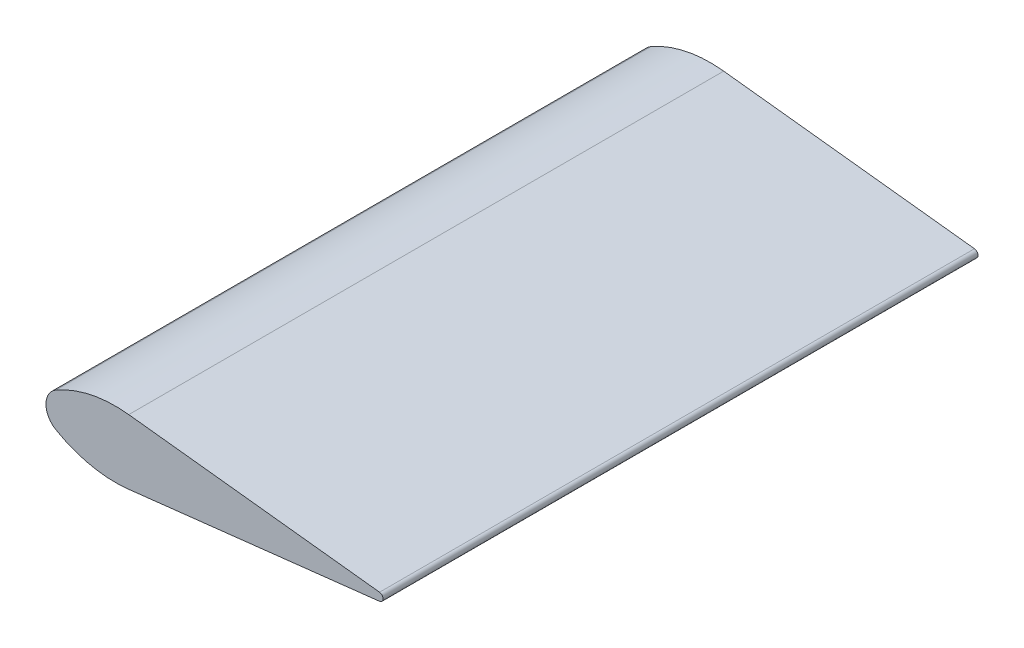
ISO-10303-21;
HEADER;
FILE_DESCRIPTION(('STEP AP214'),'2;1');
FILE_NAME('part.step','',(''),(''),'','','');
FILE_SCHEMA(('AUTOMOTIVE_DESIGN { 1 0 10303 214 1 1 1 1 }'));
ENDSEC;
DATA;
#1=APPLICATION_CONTEXT('core data for automotive mechanical design processes');
#2=APPLICATION_PROTOCOL_DEFINITION('international standard','automotive_design',2000,#1);
#3=PRODUCT_CONTEXT('',#1,'mechanical');
#4=PRODUCT('Part','Part','',(#3));
#5=PRODUCT_RELATED_PRODUCT_CATEGORY('part','',(#4));
#6=PRODUCT_DEFINITION_FORMATION('','',#4);
#7=PRODUCT_DEFINITION_CONTEXT('part definition',#1,'design');
#8=PRODUCT_DEFINITION('design','',#6,#7);
#9=PRODUCT_DEFINITION_SHAPE('','',#8);
#10=(LENGTH_UNIT() NAMED_UNIT(*) SI_UNIT(.MILLI.,.METRE.));
#11=(NAMED_UNIT(*) PLANE_ANGLE_UNIT() SI_UNIT($,.RADIAN.));
#12=(NAMED_UNIT(*) SI_UNIT($,.STERADIAN.) SOLID_ANGLE_UNIT());
#13=UNCERTAINTY_MEASURE_WITH_UNIT(LENGTH_MEASURE(1.E-05),#10,'distance_accuracy_value','');
#14=(GEOMETRIC_REPRESENTATION_CONTEXT(3) GLOBAL_UNCERTAINTY_ASSIGNED_CONTEXT((#13)) GLOBAL_UNIT_ASSIGNED_CONTEXT((#10,
#11,#12)) REPRESENTATION_CONTEXT('',''));
#15=CARTESIAN_POINT('',(0.,0.,0.));
#16=DIRECTION('',(0.,0.,1.));
#17=DIRECTION('',(1.,0.,0.));
#18=AXIS2_PLACEMENT_3D('',#15,#16,#17);
#19=CARTESIAN_POINT('',(-160.,0.,-300.));
#20=DIRECTION('',(0.,0.,1.));
#21=DIRECTION('',(-1.,0.,0.));
#22=AXIS2_PLACEMENT_3D('',#19,#20,#21);
#23=CYLINDRICAL_SURFACE('',#22,10.);
#24=CARTESIAN_POINT('',(-160.,0.,0.));
#25=DIRECTION('',(0.,0.,1.));
#26=DIRECTION('',(1.,0.,0.));
#27=AXIS2_PLACEMENT_3D('',#24,#25,#26);
#28=CIRCLE('',#27,10.);
#29=CARTESIAN_POINT('',(-165.,8.66025403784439,0.));
#30=VERTEX_POINT('',#29);
#31=CARTESIAN_POINT('',(-165.,-8.66025403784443,0.));
#32=VERTEX_POINT('',#31);
#33=EDGE_CURVE('E460',#30,#32,#28,.T.);
#34=ORIENTED_EDGE('',*,*,#33,.F.);
#35=DIRECTION('',(0.,0.,1.));
#36=VECTOR('',#35,1.);
#37=CARTESIAN_POINT('',(-165.,8.66025403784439,-300.));
#38=LINE('',#37,#36);
#39=CARTESIAN_POINT('',(-165.,8.66025403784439,-300.));
#40=VERTEX_POINT('',#39);
#41=EDGE_CURVE('E481',#40,#30,#38,.T.);
#42=ORIENTED_EDGE('',*,*,#41,.F.);
#43=CARTESIAN_POINT('',(-160.,0.,-300.));
#44=DIRECTION('',(0.,0.,1.));
#45=DIRECTION('',(1.,0.,0.));
#46=AXIS2_PLACEMENT_3D('',#43,#44,#45);
#47=CIRCLE('',#46,10.);
#48=CARTESIAN_POINT('',(-165.,-8.66025403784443,-300.));
#49=VERTEX_POINT('',#48);
#50=EDGE_CURVE('E471',#40,#49,#47,.T.);
#51=ORIENTED_EDGE('',*,*,#50,.T.);
#52=DIRECTION('',(0.,0.,1.));
#53=VECTOR('',#52,1.);
#54=CARTESIAN_POINT('',(-165.,-8.66025403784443,-300.));
#55=LINE('',#54,#53);
#56=EDGE_CURVE('E457',#49,#32,#55,.T.);
#57=ORIENTED_EDGE('',*,*,#56,.T.);
#58=EDGE_LOOP('',(#34,#42,#51,#57));
#59=FACE_BOUND('',#58,.T.);
#60=ADVANCED_FACE('F368',(#59),#23,.T.);
#61=CARTESIAN_POINT('',(-2.,0.,-300.));
#62=DIRECTION('',(0.,0.,1.));
#63=DIRECTION('',(-1.,0.,0.));
#64=AXIS2_PLACEMENT_3D('',#61,#62,#63);
#65=CYLINDRICAL_SURFACE('',#64,2.00000000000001);
#66=CARTESIAN_POINT('',(-2.,0.,0.));
#67=DIRECTION('',(0.,0.,1.));
#68=DIRECTION('',(1.,0.,0.));
#69=AXIS2_PLACEMENT_3D('',#66,#67,#68);
#70=CIRCLE('',#69,2.00000000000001);
#71=CARTESIAN_POINT('',(-1.77482640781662,-1.98728378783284,0.));
#72=VERTEX_POINT('',#71);
#73=CARTESIAN_POINT('',(-1.77482640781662,1.98728378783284,0.));
#74=VERTEX_POINT('',#73);
#75=EDGE_CURVE('E463',#72,#74,#70,.T.);
#76=ORIENTED_EDGE('',*,*,#75,.F.);
#77=DIRECTION('',(0.,0.,1.));
#78=VECTOR('',#77,1.);
#79=CARTESIAN_POINT('',(-1.77482640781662,-1.98728378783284,-300.));
#80=LINE('',#79,#78);
#81=CARTESIAN_POINT('',(-1.77482640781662,-1.98728378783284,-300.));
#82=VERTEX_POINT('',#81);
#83=EDGE_CURVE('E452',#82,#72,#80,.T.);
#84=ORIENTED_EDGE('',*,*,#83,.F.);
#85=CARTESIAN_POINT('',(-2.,0.,-300.));
#86=DIRECTION('',(0.,0.,1.));
#87=DIRECTION('',(1.,0.,0.));
#88=AXIS2_PLACEMENT_3D('',#85,#86,#87);
#89=CIRCLE('',#88,2.00000000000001);
#90=CARTESIAN_POINT('',(-1.77482640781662,1.98728378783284,-300.));
#91=VERTEX_POINT('',#90);
#92=EDGE_CURVE('E474',#82,#91,#89,.T.);
#93=ORIENTED_EDGE('',*,*,#92,.T.);
#94=DIRECTION('',(0.,0.,1.));
#95=VECTOR('',#94,1.);
#96=CARTESIAN_POINT('',(-1.77482640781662,1.98728378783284,-300.));
#97=LINE('',#96,#95);
#98=EDGE_CURVE('E11',#91,#74,#97,.T.);
#99=ORIENTED_EDGE('',*,*,#98,.T.);
#100=EDGE_LOOP('',(#76,#84,#93,#99));
#101=FACE_BOUND('',#100,.T.);
#102=ADVANCED_FACE('F492',(#101),#65,.T.);
#103=CARTESIAN_POINT('',(-128.244792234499,16.3172434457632,-300.));
#104=DIRECTION('',(-0.112586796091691,-0.993641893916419,0.));
#105=DIRECTION('',(0.993641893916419,-0.112586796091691,0.));
#106=AXIS2_PLACEMENT_3D('',#103,#104,#105);
#107=PLANE('',#106);
#108=DIRECTION('',(-0.993641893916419,0.112586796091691,0.));
#109=VECTOR('',#108,1.);
#110=CARTESIAN_POINT('',(-128.244792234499,16.3172434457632,0.));
#111=LINE('',#110,#109);
#112=CARTESIAN_POINT('',(-128.244792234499,16.3172434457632,0.));
#113=VERTEX_POINT('',#112);
#114=EDGE_CURVE('E466',#74,#113,#111,.T.);
#115=ORIENTED_EDGE('',*,*,#114,.F.);
#116=ORIENTED_EDGE('',*,*,#98,.F.);
#117=DIRECTION('',(-0.993641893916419,0.112586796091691,0.));
#118=VECTOR('',#117,1.);
#119=CARTESIAN_POINT('',(-128.244792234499,16.3172434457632,-300.));
#120=LINE('',#119,#118);
#121=CARTESIAN_POINT('',(-128.244792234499,16.3172434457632,-300.));
#122=VERTEX_POINT('',#121);
#123=EDGE_CURVE('E477',#91,#122,#120,.T.);
#124=ORIENTED_EDGE('',*,*,#123,.T.);
#125=DIRECTION('',(0.,0.,1.));
#126=VECTOR('',#125,1.);
#127=CARTESIAN_POINT('',(-128.244792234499,16.3172434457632,-300.));
#128=LINE('',#127,#126);
#129=EDGE_CURVE('E375',#122,#113,#128,.T.);
#130=ORIENTED_EDGE('',*,*,#129,.T.);
#131=EDGE_LOOP('',(#115,#116,#124,#130));
#132=FACE_BOUND('',#131,.T.);
#133=ADVANCED_FACE('F484',(#132),#107,.F.);
#134=CARTESIAN_POINT('',(-135.,-43.3012701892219,-300.));
#135=DIRECTION('',(0.,0.,1.));
#136=DIRECTION('',(-1.,0.,0.));
#137=AXIS2_PLACEMENT_3D('',#134,#135,#136);
#138=CYLINDRICAL_SURFACE('',#137,60.);
#139=CARTESIAN_POINT('',(-135.,-43.3012701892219,0.));
#140=DIRECTION('',(0.,0.,1.));
#141=DIRECTION('',(1.,0.,0.));
#142=AXIS2_PLACEMENT_3D('',#139,#140,#141);
#143=CIRCLE('',#142,60.);
#144=EDGE_CURVE('E469',#113,#30,#143,.T.);
#145=ORIENTED_EDGE('',*,*,#144,.F.);
#146=ORIENTED_EDGE('',*,*,#129,.F.);
#147=CARTESIAN_POINT('',(-135.,-43.3012701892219,-300.));
#148=DIRECTION('',(0.,0.,1.));
#149=DIRECTION('',(1.,0.,0.));
#150=AXIS2_PLACEMENT_3D('',#147,#148,#149);
#151=CIRCLE('',#150,60.);
#152=EDGE_CURVE('E382',#122,#40,#151,.T.);
#153=ORIENTED_EDGE('',*,*,#152,.T.);
#154=ORIENTED_EDGE('',*,*,#41,.T.);
#155=EDGE_LOOP('',(#145,#146,#153,#154));
#156=FACE_BOUND('',#155,.T.);
#157=ADVANCED_FACE('F504',(#156),#138,.T.);
#158=CARTESIAN_POINT('',(-160.,0.,-300.));
#159=DIRECTION('',(0.,0.,-1.));
#160=DIRECTION('',(1.,0.,0.));
#161=AXIS2_PLACEMENT_3D('',#158,#159,#160);
#162=PLANE('',#161);
#163=CARTESIAN_POINT('',(-130.,0.,-300.));
#164=DIRECTION('',(0.,0.,1.));
#165=DIRECTION('',(1.,0.,0.));
#166=AXIS2_PLACEMENT_3D('',#163,#164,#165);
#167=CIRCLE('',#166,4.24999999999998);
#168=CARTESIAN_POINT('',(-125.75,0.,-300.));
#169=VERTEX_POINT('',#168);
#170=EDGE_CURVE('E431',#169,#169,#167,.T.);
#171=ORIENTED_EDGE('',*,*,#170,.T.);
#172=EDGE_LOOP('',(#171));
#173=FACE_BOUND('',#172,.T.);
#174=CARTESIAN_POINT('',(-80.,0.,-300.));
#175=DIRECTION('',(0.,0.,1.));
#176=DIRECTION('',(1.,0.,0.));
#177=AXIS2_PLACEMENT_3D('',#174,#175,#176);
#178=CIRCLE('',#177,4.24999999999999);
#179=CARTESIAN_POINT('',(-75.75,0.,-300.));
#180=VERTEX_POINT('',#179);
#181=EDGE_CURVE('E439',#180,#180,#178,.T.);
#182=ORIENTED_EDGE('',*,*,#181,.T.);
#183=EDGE_LOOP('',(#182));
#184=FACE_BOUND('',#183,.T.);
#185=ORIENTED_EDGE('',*,*,#50,.F.);
#186=ORIENTED_EDGE('',*,*,#152,.F.);
#187=ORIENTED_EDGE('',*,*,#123,.F.);
#188=ORIENTED_EDGE('',*,*,#92,.F.);
#189=DIRECTION('',(-0.993641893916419,-0.112586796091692,0.));
#190=VECTOR('',#189,1.);
#191=CARTESIAN_POINT('',(-128.244792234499,-16.3172434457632,-300.));
#192=LINE('',#191,#190);
#193=CARTESIAN_POINT('',(-128.244792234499,-16.3172434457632,-300.));
#194=VERTEX_POINT('',#193);
#195=EDGE_CURVE('E449',#82,#194,#192,.T.);
#196=ORIENTED_EDGE('',*,*,#195,.T.);
#197=CARTESIAN_POINT('',(-135.,43.3012701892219,-300.));
#198=DIRECTION('',(0.,0.,-1.));
#199=DIRECTION('',(1.,0.,0.));
#200=AXIS2_PLACEMENT_3D('',#197,#198,#199);
#201=CIRCLE('',#200,60.);
#202=EDGE_CURVE('E447',#194,#49,#201,.T.);
#203=ORIENTED_EDGE('',*,*,#202,.T.);
#204=EDGE_LOOP('',(#185,#186,#187,#188,#196,#203));
#205=FACE_BOUND('',#204,.T.);
#206=ADVANCED_FACE('F494',(#173,#184,#205),#162,.T.);
#207=CARTESIAN_POINT('',(-160.,0.,0.));
#208=DIRECTION('',(0.,0.,-1.));
#209=DIRECTION('',(1.,0.,0.));
#210=AXIS2_PLACEMENT_3D('',#207,#208,#209);
#211=PLANE('',#210);
#212=ORIENTED_EDGE('',*,*,#33,.T.);
#213=CARTESIAN_POINT('',(-135.,43.3012701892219,0.));
#214=DIRECTION('',(0.,0.,-1.));
#215=DIRECTION('',(1.,0.,0.));
#216=AXIS2_PLACEMENT_3D('',#213,#214,#215);
#217=CIRCLE('',#216,60.);
#218=CARTESIAN_POINT('',(-128.244792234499,-16.3172434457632,0.));
#219=VERTEX_POINT('',#218);
#220=EDGE_CURVE('E442',#219,#32,#217,.T.);
#221=ORIENTED_EDGE('',*,*,#220,.F.);
#222=DIRECTION('',(-0.993641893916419,-0.112586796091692,0.));
#223=VECTOR('',#222,1.);
#224=CARTESIAN_POINT('',(-128.244792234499,-16.3172434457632,0.));
#225=LINE('',#224,#223);
#226=EDGE_CURVE('E444',#72,#219,#225,.T.);
#227=ORIENTED_EDGE('',*,*,#226,.F.);
#228=ORIENTED_EDGE('',*,*,#75,.T.);
#229=ORIENTED_EDGE('',*,*,#114,.T.);
#230=ORIENTED_EDGE('',*,*,#144,.T.);
#231=EDGE_LOOP('',(#212,#221,#227,#228,#229,#230));
#232=FACE_BOUND('',#231,.T.);
#233=ADVANCED_FACE('F487',(#232),#211,.F.);
#234=CARTESIAN_POINT('',(-135.,43.3012701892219,-300.));
#235=DIRECTION('',(0.,0.,1.));
#236=DIRECTION('',(-1.,0.,0.));
#237=AXIS2_PLACEMENT_3D('',#234,#235,#236);
#238=CYLINDRICAL_SURFACE('',#237,60.);
#239=ORIENTED_EDGE('',*,*,#220,.T.);
#240=ORIENTED_EDGE('',*,*,#56,.F.);
#241=ORIENTED_EDGE('',*,*,#202,.F.);
#242=DIRECTION('',(0.,0.,1.));
#243=VECTOR('',#242,1.);
#244=CARTESIAN_POINT('',(-128.244792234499,-16.3172434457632,-300.));
#245=LINE('',#244,#243);
#246=EDGE_CURVE('E455',#194,#219,#245,.T.);
#247=ORIENTED_EDGE('',*,*,#246,.T.);
#248=EDGE_LOOP('',(#239,#240,#241,#247));
#249=FACE_BOUND('',#248,.T.);
#250=ADVANCED_FACE('F500',(#249),#238,.T.);
#251=CARTESIAN_POINT('',(-128.244792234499,-16.3172434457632,-300.));
#252=DIRECTION('',(0.112586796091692,-0.993641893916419,0.));
#253=DIRECTION('',(0.993641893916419,0.112586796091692,0.));
#254=AXIS2_PLACEMENT_3D('',#251,#252,#253);
#255=PLANE('',#254);
#256=ORIENTED_EDGE('',*,*,#226,.T.);
#257=ORIENTED_EDGE('',*,*,#246,.F.);
#258=ORIENTED_EDGE('',*,*,#195,.F.);
#259=ORIENTED_EDGE('',*,*,#83,.T.);
#260=EDGE_LOOP('',(#256,#257,#258,#259));
#261=FACE_BOUND('',#260,.T.);
#262=ADVANCED_FACE('F498',(#261),#255,.T.);
#263=CARTESIAN_POINT('',(-80.,0.,-300.));
#264=DIRECTION('',(0.,0.,-1.));
#265=DIRECTION('',(1.,0.,0.));
#266=AXIS2_PLACEMENT_3D('',#263,#264,#265);
#267=CYLINDRICAL_SURFACE('',#266,4.24999999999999);
#268=CARTESIAN_POINT('',(-80.,0.,-275.5));
#269=DIRECTION('',(0.,0.,1.));
#270=DIRECTION('',(1.,0.,0.));
#271=AXIS2_PLACEMENT_3D('',#268,#269,#270);
#272=CIRCLE('',#271,4.24999999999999);
#273=CARTESIAN_POINT('',(-75.75,0.,-275.5));
#274=VERTEX_POINT('',#273);
#275=EDGE_CURVE('E434',#274,#274,#272,.T.);
#276=ORIENTED_EDGE('',*,*,#275,.T.);
#277=EDGE_LOOP('',(#276));
#278=FACE_BOUND('',#277,.T.);
#279=ORIENTED_EDGE('',*,*,#181,.F.);
#280=EDGE_LOOP('',(#279));
#281=FACE_BOUND('',#280,.T.);
#282=ADVANCED_FACE('F556',(#278,#281),#267,.F.);
#283=CARTESIAN_POINT('',(-80.,0.,-275.5));
#284=DIRECTION('',(0.,0.,-1.));
#285=DIRECTION('',(1.,0.,0.));
#286=AXIS2_PLACEMENT_3D('',#283,#284,#285);
#287=CONICAL_SURFACE('',#286,4.24999999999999,1.02974425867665);
#288=CARTESIAN_POINT('',(-80.,0.,-272.946342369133));
#289=VERTEX_POINT('',#288);
#290=VERTEX_LOOP('',#289);
#291=FACE_BOUND('',#290,.T.);
#292=ORIENTED_EDGE('',*,*,#275,.F.);
#293=EDGE_LOOP('',(#292));
#294=FACE_BOUND('',#293,.T.);
#295=ADVANCED_FACE('F564',(#291,#294),#287,.F.);
#296=CARTESIAN_POINT('',(-130.,0.,-300.));
#297=DIRECTION('',(0.,0.,-1.));
#298=DIRECTION('',(1.,0.,0.));
#299=AXIS2_PLACEMENT_3D('',#296,#297,#298);
#300=CYLINDRICAL_SURFACE('',#299,4.24999999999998);
#301=CARTESIAN_POINT('',(-130.,0.,-275.5));
#302=DIRECTION('',(0.,0.,1.));
#303=DIRECTION('',(1.,0.,0.));
#304=AXIS2_PLACEMENT_3D('',#301,#302,#303);
#305=CIRCLE('',#304,4.24999999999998);
#306=CARTESIAN_POINT('',(-125.75,0.,-275.5));
#307=VERTEX_POINT('',#306);
#308=EDGE_CURVE('E429',#307,#307,#305,.T.);
#309=ORIENTED_EDGE('',*,*,#308,.T.);
#310=EDGE_LOOP('',(#309));
#311=FACE_BOUND('',#310,.T.);
#312=ORIENTED_EDGE('',*,*,#170,.F.);
#313=EDGE_LOOP('',(#312));
#314=FACE_BOUND('',#313,.T.);
#315=ADVANCED_FACE('F425',(#311,#314),#300,.F.);
#316=CARTESIAN_POINT('',(-130.,0.,-275.5));
#317=DIRECTION('',(0.,0.,-1.));
#318=DIRECTION('',(1.,0.,0.));
#319=AXIS2_PLACEMENT_3D('',#316,#317,#318);
#320=CONICAL_SURFACE('',#319,4.24999999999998,1.02974425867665);
#321=CARTESIAN_POINT('',(-130.,0.,-272.946342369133));
#322=VERTEX_POINT('',#321);
#323=VERTEX_LOOP('',#322);
#324=FACE_BOUND('',#323,.T.);
#325=ORIENTED_EDGE('',*,*,#308,.F.);
#326=EDGE_LOOP('',(#325));
#327=FACE_BOUND('',#326,.T.);
#328=ADVANCED_FACE('F422',(#324,#327),#320,.F.);
#329=CLOSED_SHELL('',(#60,#102,#133,#157,#206,#233,#250,#262,#282,#295,#315,#328));
#330=MANIFOLD_SOLID_BREP('B2',#329);
#331=ADVANCED_BREP_SHAPE_REPRESENTATION('',(#18,#330),#14);
#332=SHAPE_DEFINITION_REPRESENTATION(#9,#331);
ENDSEC;
END-ISO-10303-21;
